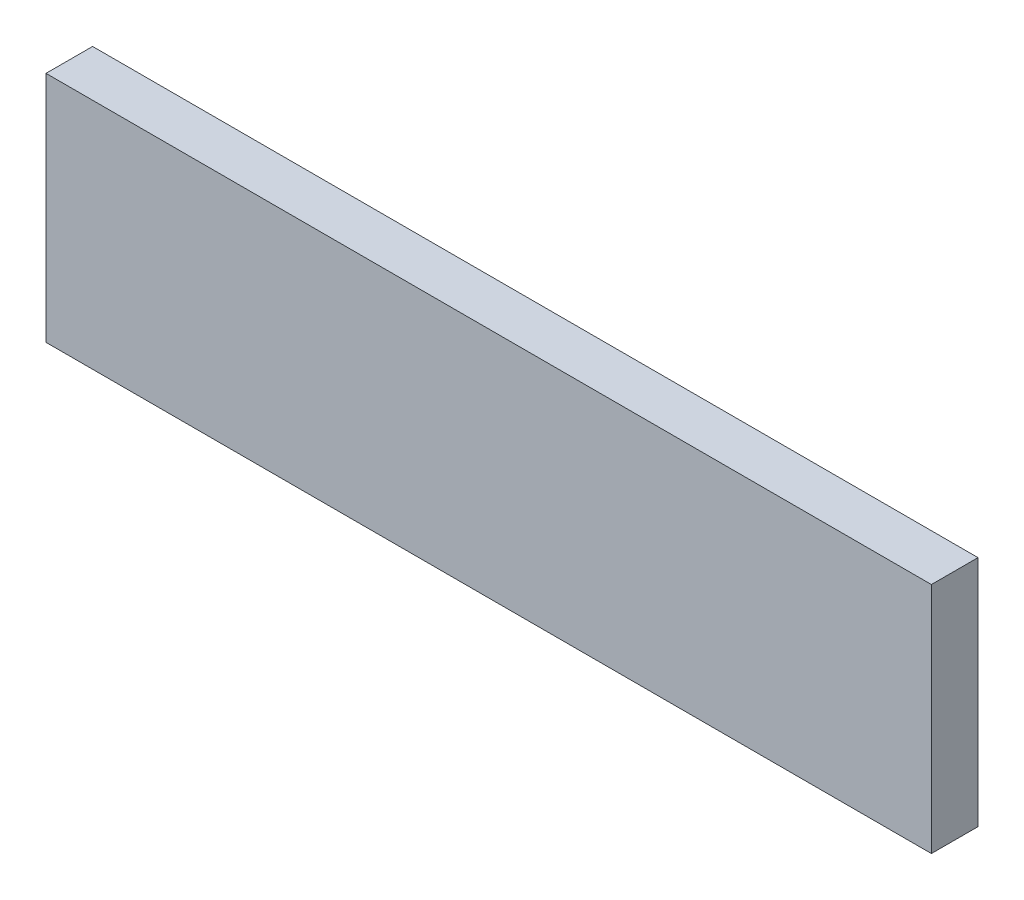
from build123d import *

# Parameters (mm, degrees)
ESQUISSE1_W      = 114
ESQUISSE1_H      = 30
EXTRUSION1_DEPTH = 6


with BuildPart() as part:
    # Esquisse1 → Extrusion1 (new body)
    with BuildSketch(Plane.XY):
        with Locations((-3, 15)):
            Rectangle(ESQUISSE1_W, ESQUISSE1_H)
    extrude(amount=EXTRUSION1_DEPTH)


solid = part.part
